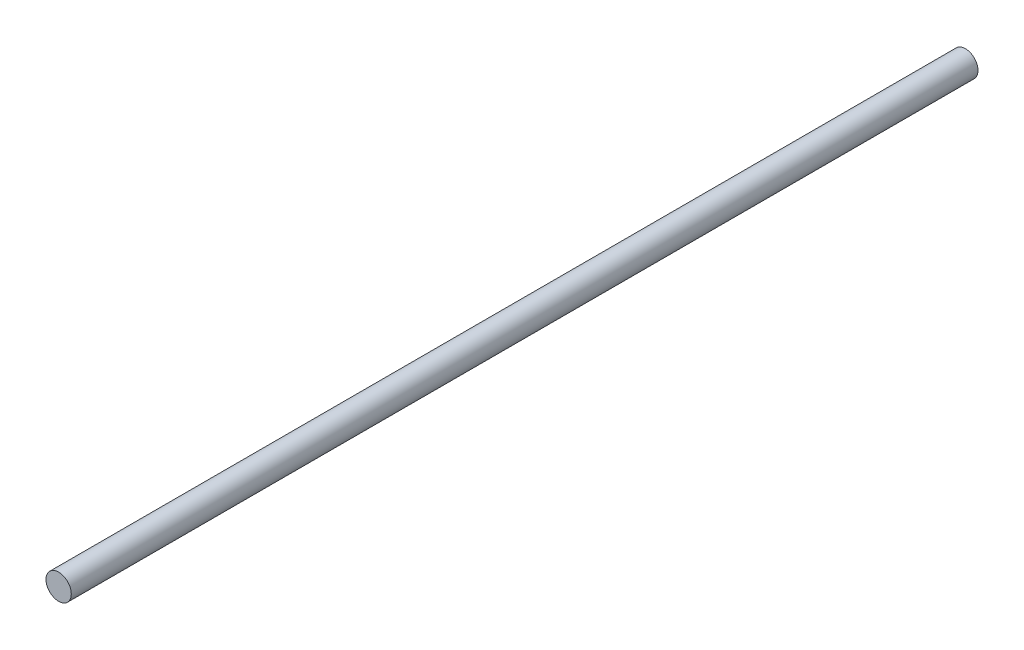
ISO-10303-21;
HEADER;
FILE_DESCRIPTION(('STEP AP214'),'2;1');
FILE_NAME('part.step','',(''),(''),'','','');
FILE_SCHEMA(('AUTOMOTIVE_DESIGN { 1 0 10303 214 1 1 1 1 }'));
ENDSEC;
DATA;
#1=APPLICATION_CONTEXT('core data for automotive mechanical design processes');
#2=APPLICATION_PROTOCOL_DEFINITION('international standard','automotive_design',2000,#1);
#3=PRODUCT_CONTEXT('',#1,'mechanical');
#4=PRODUCT('Part','Part','',(#3));
#5=PRODUCT_RELATED_PRODUCT_CATEGORY('part','',(#4));
#6=PRODUCT_DEFINITION_FORMATION('','',#4);
#7=PRODUCT_DEFINITION_CONTEXT('part definition',#1,'design');
#8=PRODUCT_DEFINITION('design','',#6,#7);
#9=PRODUCT_DEFINITION_SHAPE('','',#8);
#10=(LENGTH_UNIT() NAMED_UNIT(*) SI_UNIT(.MILLI.,.METRE.));
#11=(NAMED_UNIT(*) PLANE_ANGLE_UNIT() SI_UNIT($,.RADIAN.));
#12=(NAMED_UNIT(*) SI_UNIT($,.STERADIAN.) SOLID_ANGLE_UNIT());
#13=UNCERTAINTY_MEASURE_WITH_UNIT(LENGTH_MEASURE(1.E-05),#10,'distance_accuracy_value','');
#14=(GEOMETRIC_REPRESENTATION_CONTEXT(3) GLOBAL_UNCERTAINTY_ASSIGNED_CONTEXT((#13)) GLOBAL_UNIT_ASSIGNED_CONTEXT((#10,
#11,#12)) REPRESENTATION_CONTEXT('',''));
#15=CARTESIAN_POINT('',(0.,0.,0.));
#16=DIRECTION('',(0.,0.,1.));
#17=DIRECTION('',(1.,0.,0.));
#18=AXIS2_PLACEMENT_3D('',#15,#16,#17);
#19=CARTESIAN_POINT('',(0.,0.,-2150.));
#20=DIRECTION('',(0.,0.,1.));
#21=DIRECTION('',(1.,0.,0.));
#22=AXIS2_PLACEMENT_3D('',#19,#20,#21);
#23=CYLINDRICAL_SURFACE('',#22,30.);
#24=CARTESIAN_POINT('',(0.,0.,-2150.));
#25=DIRECTION('',(0.,0.,1.));
#26=DIRECTION('',(1.,0.,0.));
#27=AXIS2_PLACEMENT_3D('',#24,#25,#26);
#28=CIRCLE('',#27,30.);
#29=CARTESIAN_POINT('',(30.,0.,-2150.));
#30=VERTEX_POINT('',#29);
#31=EDGE_CURVE('E10',#30,#30,#28,.T.);
#32=ORIENTED_EDGE('',*,*,#31,.T.);
#33=EDGE_LOOP('',(#32));
#34=FACE_BOUND('',#33,.T.);
#35=CARTESIAN_POINT('',(0.,0.,0.));
#36=DIRECTION('',(0.,0.,1.));
#37=DIRECTION('',(1.,0.,0.));
#38=AXIS2_PLACEMENT_3D('',#35,#36,#37);
#39=CIRCLE('',#38,30.);
#40=CARTESIAN_POINT('',(30.,0.,0.));
#41=VERTEX_POINT('',#40);
#42=EDGE_CURVE('E40',#41,#41,#39,.T.);
#43=ORIENTED_EDGE('',*,*,#42,.F.);
#44=EDGE_LOOP('',(#43));
#45=FACE_BOUND('',#44,.T.);
#46=ADVANCED_FACE('F37',(#34,#45),#23,.T.);
#47=CARTESIAN_POINT('',(0.,0.,-2150.));
#48=DIRECTION('',(0.,0.,1.));
#49=DIRECTION('',(1.,0.,0.));
#50=AXIS2_PLACEMENT_3D('',#47,#48,#49);
#51=PLANE('',#50);
#52=ORIENTED_EDGE('',*,*,#31,.F.);
#53=EDGE_LOOP('',(#52));
#54=FACE_BOUND('',#53,.T.);
#55=ADVANCED_FACE('F54',(#54),#51,.F.);
#56=CARTESIAN_POINT('',(0.,0.,0.));
#57=DIRECTION('',(0.,0.,1.));
#58=DIRECTION('',(1.,0.,0.));
#59=AXIS2_PLACEMENT_3D('',#56,#57,#58);
#60=PLANE('',#59);
#61=ORIENTED_EDGE('',*,*,#42,.T.);
#62=EDGE_LOOP('',(#61));
#63=FACE_BOUND('',#62,.T.);
#64=ADVANCED_FACE('F51',(#63),#60,.T.);
#65=CLOSED_SHELL('',(#46,#55,#64));
#66=MANIFOLD_SOLID_BREP('B2',#65);
#67=ADVANCED_BREP_SHAPE_REPRESENTATION('',(#18,#66),#14);
#68=SHAPE_DEFINITION_REPRESENTATION(#9,#67);
ENDSEC;
END-ISO-10303-21;
